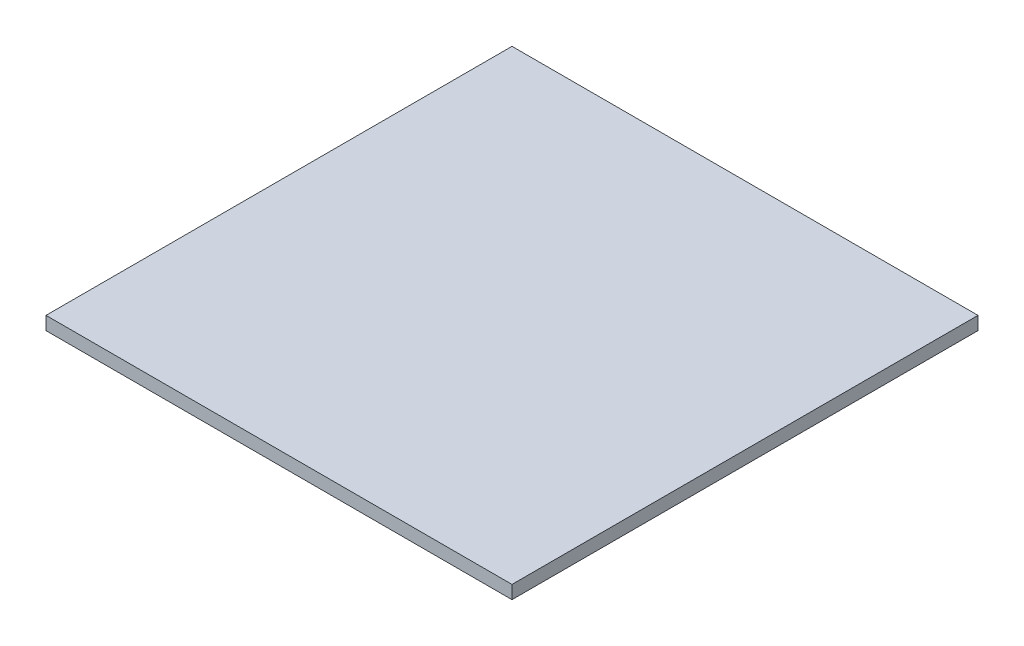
from build123d import *

# Parameters (mm, degrees)
SKETCH1_W           = 176
SKETCH1_H           = 176
BOSS_EXTRUDE1_DEPTH = 5


with BuildPart() as part:
    # Sketch1 → Boss-Extrude1 (new body)
    with BuildSketch(Plane(origin=(0, 0, 0), x_dir=(1, 0, 0), z_dir=(0, 1, 0))):
        Rectangle(SKETCH1_W, SKETCH1_H)
    extrude(amount=BOSS_EXTRUDE1_DEPTH)


solid = part.part
